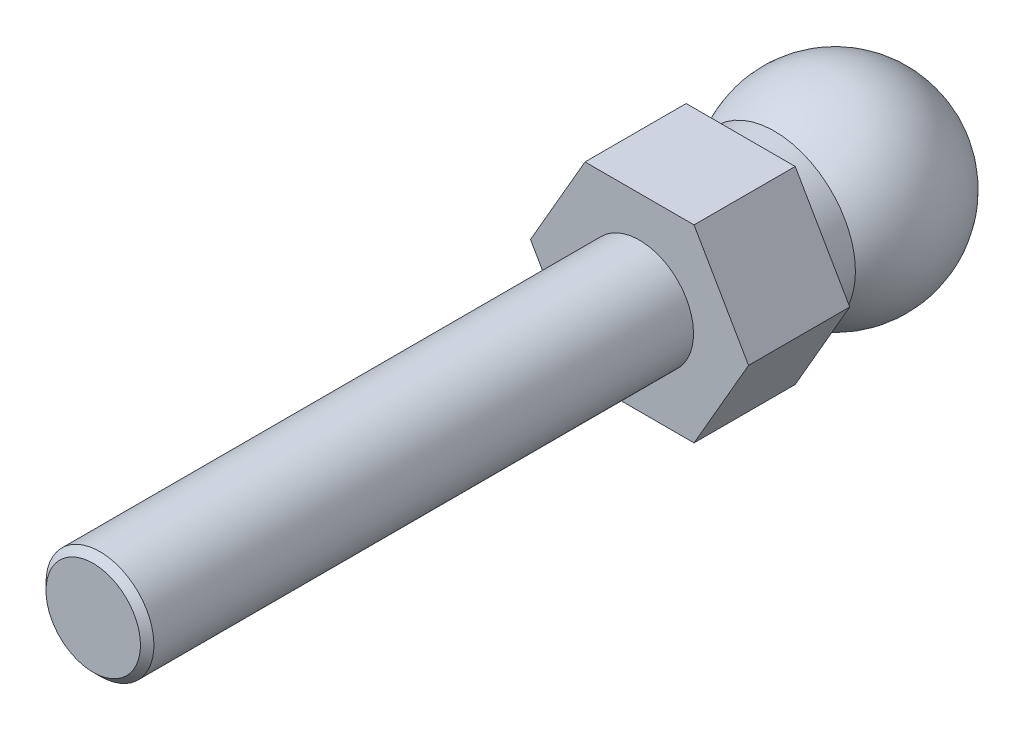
ISO-10303-21;
HEADER;
FILE_DESCRIPTION(('STEP AP214'),'2;1');
FILE_NAME('part.step','',(''),(''),'','','');
FILE_SCHEMA(('AUTOMOTIVE_DESIGN { 1 0 10303 214 1 1 1 1 }'));
ENDSEC;
DATA;
#1=APPLICATION_CONTEXT('core data for automotive mechanical design processes');
#2=APPLICATION_PROTOCOL_DEFINITION('international standard','automotive_design',2000,#1);
#3=PRODUCT_CONTEXT('',#1,'mechanical');
#4=PRODUCT('Part','Part','',(#3));
#5=PRODUCT_RELATED_PRODUCT_CATEGORY('part','',(#4));
#6=PRODUCT_DEFINITION_FORMATION('','',#4);
#7=PRODUCT_DEFINITION_CONTEXT('part definition',#1,'design');
#8=PRODUCT_DEFINITION('design','',#6,#7);
#9=PRODUCT_DEFINITION_SHAPE('','',#8);
#10=(LENGTH_UNIT() NAMED_UNIT(*) SI_UNIT(.MILLI.,.METRE.));
#11=(NAMED_UNIT(*) PLANE_ANGLE_UNIT() SI_UNIT($,.RADIAN.));
#12=(NAMED_UNIT(*) SI_UNIT($,.STERADIAN.) SOLID_ANGLE_UNIT());
#13=UNCERTAINTY_MEASURE_WITH_UNIT(LENGTH_MEASURE(1.E-05),#10,'distance_accuracy_value','');
#14=(GEOMETRIC_REPRESENTATION_CONTEXT(3) GLOBAL_UNCERTAINTY_ASSIGNED_CONTEXT((#13)) GLOBAL_UNIT_ASSIGNED_CONTEXT((#10,
#11,#12)) REPRESENTATION_CONTEXT('',''));
#15=CARTESIAN_POINT('',(0.,0.,0.));
#16=DIRECTION('',(0.,0.,1.));
#17=DIRECTION('',(1.,0.,0.));
#18=AXIS2_PLACEMENT_3D('',#15,#16,#17);
#19=CARTESIAN_POINT('',(0.,0.,0.));
#20=DIRECTION('',(1.,0.,0.));
#21=DIRECTION('',(0.,1.,0.));
#22=AXIS2_PLACEMENT_3D('',#19,#20,#21);
#23=SPHERICAL_SURFACE('',#22,7.5);
#24=CARTESIAN_POINT('',(-7.5,0.,0.));
#25=VERTEX_POINT('',#24);
#26=VERTEX_LOOP('',#25);
#27=FACE_BOUND('',#26,.T.);
#28=CARTESIAN_POINT('',(7.5,0.,0.));
#29=VERTEX_POINT('',#28);
#30=VERTEX_LOOP('',#29);
#31=FACE_BOUND('',#30,.T.);
#32=CARTESIAN_POINT('',(0.,0.,4.5));
#33=DIRECTION('',(0.,0.,1.));
#34=DIRECTION('',(1.,0.,0.));
#35=AXIS2_PLACEMENT_3D('',#32,#33,#34);
#36=CIRCLE('',#35,6.);
#37=CARTESIAN_POINT('',(6.,0.,4.5));
#38=VERTEX_POINT('',#37);
#39=EDGE_CURVE('E20',#38,#38,#36,.T.);
#40=ORIENTED_EDGE('',*,*,#39,.F.);
#41=EDGE_LOOP('',(#40));
#42=FACE_BOUND('',#41,.T.);
#43=ADVANCED_FACE('F16',(#27,#31,#42),#23,.T.);
#44=CARTESIAN_POINT('',(0.,0.,0.));
#45=DIRECTION('',(0.,0.,1.));
#46=DIRECTION('',(1.,0.,0.));
#47=AXIS2_PLACEMENT_3D('',#44,#45,#46);
#48=CYLINDRICAL_SURFACE('',#47,6.);
#49=ORIENTED_EDGE('',*,*,#39,.T.);
#50=EDGE_LOOP('',(#49));
#51=FACE_BOUND('',#50,.T.);
#52=CARTESIAN_POINT('',(0.,0.,7.));
#53=DIRECTION('',(0.,0.,1.));
#54=DIRECTION('',(1.,0.,0.));
#55=AXIS2_PLACEMENT_3D('',#52,#53,#54);
#56=CIRCLE('',#55,6.);
#57=CARTESIAN_POINT('',(6.,0.,7.));
#58=VERTEX_POINT('',#57);
#59=EDGE_CURVE('E79',#58,#58,#56,.F.);
#60=ORIENTED_EDGE('',*,*,#59,.T.);
#61=EDGE_LOOP('',(#60));
#62=FACE_BOUND('',#61,.T.);
#63=ADVANCED_FACE('F74',(#51,#62),#48,.T.);
#64=CARTESIAN_POINT('',(0.,0.,7.));
#65=DIRECTION('',(0.,0.,1.));
#66=DIRECTION('',(1.,0.,0.));
#67=AXIS2_PLACEMENT_3D('',#64,#65,#66);
#68=PLANE('',#67);
#69=ORIENTED_EDGE('',*,*,#59,.F.);
#70=EDGE_LOOP('',(#69));
#71=FACE_BOUND('',#70,.T.);
#72=DIRECTION('',(-0.500000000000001,0.866025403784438,0.));
#73=VECTOR('',#72,1.);
#74=CARTESIAN_POINT('',(4.04145188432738,7.,7.));
#75=LINE('',#74,#73);
#76=CARTESIAN_POINT('',(8.08290376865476,0.,7.));
#77=VERTEX_POINT('',#76);
#78=CARTESIAN_POINT('',(4.04145188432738,7.,7.));
#79=VERTEX_POINT('',#78);
#80=EDGE_CURVE('E81',#77,#79,#75,.T.);
#81=ORIENTED_EDGE('',*,*,#80,.F.);
#82=DIRECTION('',(0.5,0.866025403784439,0.));
#83=VECTOR('',#82,1.);
#84=CARTESIAN_POINT('',(8.08290376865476,0.,7.));
#85=LINE('',#84,#83);
#86=CARTESIAN_POINT('',(4.04145188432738,-7.,7.));
#87=VERTEX_POINT('',#86);
#88=EDGE_CURVE('E114',#87,#77,#85,.T.);
#89=ORIENTED_EDGE('',*,*,#88,.F.);
#90=DIRECTION('',(1.,0.,0.));
#91=VECTOR('',#90,1.);
#92=CARTESIAN_POINT('',(4.04145188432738,-7.,7.));
#93=LINE('',#92,#91);
#94=CARTESIAN_POINT('',(-4.04145188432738,-7.,7.));
#95=VERTEX_POINT('',#94);
#96=EDGE_CURVE('E111',#95,#87,#93,.T.);
#97=ORIENTED_EDGE('',*,*,#96,.F.);
#98=DIRECTION('',(0.5,-0.866025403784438,0.));
#99=VECTOR('',#98,1.);
#100=CARTESIAN_POINT('',(-4.04145188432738,-7.,7.));
#101=LINE('',#100,#99);
#102=CARTESIAN_POINT('',(-8.08290376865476,0.,7.));
#103=VERTEX_POINT('',#102);
#104=EDGE_CURVE('E106',#103,#95,#101,.T.);
#105=ORIENTED_EDGE('',*,*,#104,.F.);
#106=DIRECTION('',(-0.5,-0.866025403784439,0.));
#107=VECTOR('',#106,1.);
#108=CARTESIAN_POINT('',(-8.08290376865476,0.,7.));
#109=LINE('',#108,#107);
#110=CARTESIAN_POINT('',(-4.04145188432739,7.,7.));
#111=VERTEX_POINT('',#110);
#112=EDGE_CURVE('E101',#111,#103,#109,.T.);
#113=ORIENTED_EDGE('',*,*,#112,.F.);
#114=DIRECTION('',(1.,0.,0.));
#115=VECTOR('',#114,1.);
#116=CARTESIAN_POINT('',(-4.04145188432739,7.,7.));
#117=LINE('',#116,#115);
#118=EDGE_CURVE('E96',#79,#111,#117,.F.);
#119=ORIENTED_EDGE('',*,*,#118,.F.);
#120=EDGE_LOOP('',(#81,#89,#97,#105,#113,#119));
#121=FACE_BOUND('',#120,.T.);
#122=ADVANCED_FACE('F235',(#71,#121),#68,.F.);
#123=CARTESIAN_POINT('',(4.04145188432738,7.,7.));
#124=DIRECTION('',(0.866025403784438,0.500000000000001,0.));
#125=DIRECTION('',(-0.500000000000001,0.866025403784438,0.));
#126=AXIS2_PLACEMENT_3D('',#123,#124,#125);
#127=PLANE('',#126);
#128=ORIENTED_EDGE('',*,*,#80,.T.);
#129=DIRECTION('',(0.,0.,1.));
#130=VECTOR('',#129,1.);
#131=CARTESIAN_POINT('',(4.04145188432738,7.,7.));
#132=LINE('',#131,#130);
#133=CARTESIAN_POINT('',(4.04145188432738,7.,14.5));
#134=VERTEX_POINT('',#133);
#135=EDGE_CURVE('E84',#134,#79,#132,.F.);
#136=ORIENTED_EDGE('',*,*,#135,.F.);
#137=DIRECTION('',(-0.500000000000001,0.866025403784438,0.));
#138=VECTOR('',#137,1.);
#139=CARTESIAN_POINT('',(8.08290376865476,0.,14.5));
#140=LINE('',#139,#138);
#141=CARTESIAN_POINT('',(8.08290376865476,0.,14.5));
#142=VERTEX_POINT('',#141);
#143=EDGE_CURVE('E120',#142,#134,#140,.T.);
#144=ORIENTED_EDGE('',*,*,#143,.F.);
#145=DIRECTION('',(0.,0.,1.));
#146=VECTOR('',#145,1.);
#147=CARTESIAN_POINT('',(8.08290376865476,0.,7.));
#148=LINE('',#147,#146);
#149=EDGE_CURVE('E117',#77,#142,#148,.T.);
#150=ORIENTED_EDGE('',*,*,#149,.F.);
#151=EDGE_LOOP('',(#128,#136,#144,#150));
#152=FACE_BOUND('',#151,.T.);
#153=ADVANCED_FACE('F145',(#152),#127,.T.);
#154=CARTESIAN_POINT('',(-4.04145188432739,7.,7.));
#155=DIRECTION('',(0.,1.,0.));
#156=DIRECTION('',(0.,0.,1.));
#157=AXIS2_PLACEMENT_3D('',#154,#155,#156);
#158=PLANE('',#157);
#159=ORIENTED_EDGE('',*,*,#118,.T.);
#160=DIRECTION('',(0.,0.,1.));
#161=VECTOR('',#160,1.);
#162=CARTESIAN_POINT('',(-4.04145188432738,7.,7.));
#163=LINE('',#162,#161);
#164=CARTESIAN_POINT('',(-4.04145188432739,7.,14.5));
#165=VERTEX_POINT('',#164);
#166=EDGE_CURVE('E98',#165,#111,#163,.F.);
#167=ORIENTED_EDGE('',*,*,#166,.F.);
#168=DIRECTION('',(1.,0.,0.));
#169=VECTOR('',#168,1.);
#170=CARTESIAN_POINT('',(0.,7.,14.5));
#171=LINE('',#170,#169);
#172=EDGE_CURVE('E123',#134,#165,#171,.F.);
#173=ORIENTED_EDGE('',*,*,#172,.F.);
#174=ORIENTED_EDGE('',*,*,#135,.T.);
#175=EDGE_LOOP('',(#159,#167,#173,#174));
#176=FACE_BOUND('',#175,.T.);
#177=ADVANCED_FACE('F149',(#176),#158,.T.);
#178=CARTESIAN_POINT('',(-8.08290376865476,0.,7.));
#179=DIRECTION('',(-0.866025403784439,0.5,0.));
#180=DIRECTION('',(-0.5,-0.866025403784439,0.));
#181=AXIS2_PLACEMENT_3D('',#178,#179,#180);
#182=PLANE('',#181);
#183=ORIENTED_EDGE('',*,*,#112,.T.);
#184=DIRECTION('',(0.,0.,1.));
#185=VECTOR('',#184,1.);
#186=CARTESIAN_POINT('',(-8.08290376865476,0.,7.));
#187=LINE('',#186,#185);
#188=CARTESIAN_POINT('',(-8.08290376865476,0.,14.5));
#189=VERTEX_POINT('',#188);
#190=EDGE_CURVE('E103',#189,#103,#187,.F.);
#191=ORIENTED_EDGE('',*,*,#190,.F.);
#192=DIRECTION('',(-0.5,-0.866025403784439,0.));
#193=VECTOR('',#192,1.);
#194=CARTESIAN_POINT('',(-4.04145188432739,7.,14.5));
#195=LINE('',#194,#193);
#196=EDGE_CURVE('E126',#165,#189,#195,.T.);
#197=ORIENTED_EDGE('',*,*,#196,.F.);
#198=ORIENTED_EDGE('',*,*,#166,.T.);
#199=EDGE_LOOP('',(#183,#191,#197,#198));
#200=FACE_BOUND('',#199,.T.);
#201=ADVANCED_FACE('F153',(#200),#182,.T.);
#202=CARTESIAN_POINT('',(-4.04145188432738,-7.,7.));
#203=DIRECTION('',(-0.866025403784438,-0.5,0.));
#204=DIRECTION('',(0.5,-0.866025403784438,0.));
#205=AXIS2_PLACEMENT_3D('',#202,#203,#204);
#206=PLANE('',#205);
#207=ORIENTED_EDGE('',*,*,#104,.T.);
#208=DIRECTION('',(0.,0.,-1.));
#209=VECTOR('',#208,1.);
#210=CARTESIAN_POINT('',(-4.04145188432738,-7.,7.));
#211=LINE('',#210,#209);
#212=CARTESIAN_POINT('',(-4.04145188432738,-7.,14.5));
#213=VERTEX_POINT('',#212);
#214=EDGE_CURVE('E108',#213,#95,#211,.T.);
#215=ORIENTED_EDGE('',*,*,#214,.F.);
#216=DIRECTION('',(0.5,-0.866025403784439,0.));
#217=VECTOR('',#216,1.);
#218=CARTESIAN_POINT('',(-8.08290376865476,0.,14.5));
#219=LINE('',#218,#217);
#220=EDGE_CURVE('E129',#189,#213,#219,.T.);
#221=ORIENTED_EDGE('',*,*,#220,.F.);
#222=ORIENTED_EDGE('',*,*,#190,.T.);
#223=EDGE_LOOP('',(#207,#215,#221,#222));
#224=FACE_BOUND('',#223,.T.);
#225=ADVANCED_FACE('F157',(#224),#206,.T.);
#226=CARTESIAN_POINT('',(4.04145188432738,-7.,7.));
#227=DIRECTION('',(0.,-1.,0.));
#228=DIRECTION('',(0.,0.,-1.));
#229=AXIS2_PLACEMENT_3D('',#226,#227,#228);
#230=PLANE('',#229);
#231=ORIENTED_EDGE('',*,*,#96,.T.);
#232=DIRECTION('',(0.,0.,1.));
#233=VECTOR('',#232,1.);
#234=CARTESIAN_POINT('',(4.04145188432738,-7.,7.));
#235=LINE('',#234,#233);
#236=CARTESIAN_POINT('',(4.04145188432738,-7.,14.5));
#237=VERTEX_POINT('',#236);
#238=EDGE_CURVE('E35',#237,#87,#235,.F.);
#239=ORIENTED_EDGE('',*,*,#238,.F.);
#240=DIRECTION('',(1.,0.,0.));
#241=VECTOR('',#240,1.);
#242=CARTESIAN_POINT('',(0.,-7.,14.5));
#243=LINE('',#242,#241);
#244=EDGE_CURVE('E132',#213,#237,#243,.T.);
#245=ORIENTED_EDGE('',*,*,#244,.F.);
#246=ORIENTED_EDGE('',*,*,#214,.T.);
#247=EDGE_LOOP('',(#231,#239,#245,#246));
#248=FACE_BOUND('',#247,.T.);
#249=ADVANCED_FACE('F159',(#248),#230,.T.);
#250=CARTESIAN_POINT('',(8.08290376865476,0.,7.));
#251=DIRECTION('',(0.866025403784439,-0.5,0.));
#252=DIRECTION('',(0.5,0.866025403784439,0.));
#253=AXIS2_PLACEMENT_3D('',#250,#251,#252);
#254=PLANE('',#253);
#255=ORIENTED_EDGE('',*,*,#88,.T.);
#256=ORIENTED_EDGE('',*,*,#149,.T.);
#257=DIRECTION('',(0.5,0.866025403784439,0.));
#258=VECTOR('',#257,1.);
#259=CARTESIAN_POINT('',(4.04145188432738,-7.,14.5));
#260=LINE('',#259,#258);
#261=EDGE_CURVE('E90',#237,#142,#260,.T.);
#262=ORIENTED_EDGE('',*,*,#261,.F.);
#263=ORIENTED_EDGE('',*,*,#238,.T.);
#264=EDGE_LOOP('',(#255,#256,#262,#263));
#265=FACE_BOUND('',#264,.T.);
#266=ADVANCED_FACE('F141',(#265),#254,.T.);
#267=CARTESIAN_POINT('',(0.,0.,55.));
#268=DIRECTION('',(0.,0.,-1.));
#269=DIRECTION('',(-1.,0.,0.));
#270=AXIS2_PLACEMENT_3D('',#267,#268,#269);
#271=PLANE('',#270);
#272=CARTESIAN_POINT('',(0.,0.,55.0000000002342));
#273=DIRECTION('',(0.,0.,-1.));
#274=DIRECTION('',(-1.,0.,0.));
#275=AXIS2_PLACEMENT_3D('',#272,#273,#274);
#276=CIRCLE('',#275,3.5000000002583);
#277=CARTESIAN_POINT('',(-3.5000000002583,0.,55.0000000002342));
#278=VERTEX_POINT('',#277);
#279=EDGE_CURVE('E87',#278,#278,#276,.T.);
#280=ORIENTED_EDGE('',*,*,#279,.F.);
#281=EDGE_LOOP('',(#280));
#282=FACE_BOUND('',#281,.T.);
#283=ADVANCED_FACE('F167',(#282),#271,.F.);
#284=CARTESIAN_POINT('',(0.,0.,14.5));
#285=DIRECTION('',(0.,0.,1.));
#286=DIRECTION('',(1.,0.,0.));
#287=AXIS2_PLACEMENT_3D('',#284,#285,#286);
#288=PLANE('',#287);
#289=CARTESIAN_POINT('',(0.,0.,14.5));
#290=DIRECTION('',(0.,0.,1.));
#291=DIRECTION('',(0.,-1.,0.));
#292=AXIS2_PLACEMENT_3D('',#289,#290,#291);
#293=CIRCLE('',#292,4.);
#294=CARTESIAN_POINT('',(0.,-4.,14.5));
#295=VERTEX_POINT('',#294);
#296=EDGE_CURVE('E26',#295,#295,#293,.T.);
#297=ORIENTED_EDGE('',*,*,#296,.F.);
#298=EDGE_LOOP('',(#297));
#299=FACE_BOUND('',#298,.T.);
#300=ORIENTED_EDGE('',*,*,#244,.T.);
#301=ORIENTED_EDGE('',*,*,#261,.T.);
#302=ORIENTED_EDGE('',*,*,#143,.T.);
#303=ORIENTED_EDGE('',*,*,#172,.T.);
#304=ORIENTED_EDGE('',*,*,#196,.T.);
#305=ORIENTED_EDGE('',*,*,#220,.T.);
#306=EDGE_LOOP('',(#300,#301,#302,#303,#304,#305));
#307=FACE_BOUND('',#306,.T.);
#308=ADVANCED_FACE('F139',(#299,#307),#288,.T.);
#309=CARTESIAN_POINT('',(0.,0.,54.4999999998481));
#310=DIRECTION('',(0.,0.,-1.));
#311=DIRECTION('',(-1.,0.,0.));
#312=AXIS2_PLACEMENT_3D('',#309,#310,#311);
#313=CONICAL_SURFACE('',#312,3.99999999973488,0.785398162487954);
#314=CARTESIAN_POINT('',(0.,0.,54.5));
#315=DIRECTION('',(0.,0.,1.));
#316=DIRECTION('',(0.,-1.,0.));
#317=AXIS2_PLACEMENT_3D('',#314,#315,#316);
#318=CIRCLE('',#317,4.);
#319=CARTESIAN_POINT('',(0.,-4.,54.5));
#320=VERTEX_POINT('',#319);
#321=EDGE_CURVE('E11',#320,#320,#318,.F.);
#322=ORIENTED_EDGE('',*,*,#321,.F.);
#323=EDGE_LOOP('',(#322));
#324=FACE_BOUND('',#323,.T.);
#325=ORIENTED_EDGE('',*,*,#279,.T.);
#326=EDGE_LOOP('',(#325));
#327=FACE_BOUND('',#326,.T.);
#328=ADVANCED_FACE('F172',(#324,#327),#313,.T.);
#329=CARTESIAN_POINT('',(0.,0.,14.5));
#330=DIRECTION('',(0.,0.,1.));
#331=DIRECTION('',(0.,-1.,0.));
#332=AXIS2_PLACEMENT_3D('',#329,#330,#331);
#333=CYLINDRICAL_SURFACE('',#332,4.);
#334=ORIENTED_EDGE('',*,*,#321,.T.);
#335=EDGE_LOOP('',(#334));
#336=FACE_BOUND('',#335,.T.);
#337=ORIENTED_EDGE('',*,*,#296,.T.);
#338=EDGE_LOOP('',(#337));
#339=FACE_BOUND('',#338,.T.);
#340=ADVANCED_FACE('F170',(#336,#339),#333,.T.);
#341=CLOSED_SHELL('',(#43,#63,#122,#153,#177,#201,#225,#249,#266,#283,#308,#328,#340));
#342=MANIFOLD_SOLID_BREP('B1',#341);
#343=ADVANCED_BREP_SHAPE_REPRESENTATION('',(#18,#342),#14);
#344=SHAPE_DEFINITION_REPRESENTATION(#9,#343);
ENDSEC;
END-ISO-10303-21;
